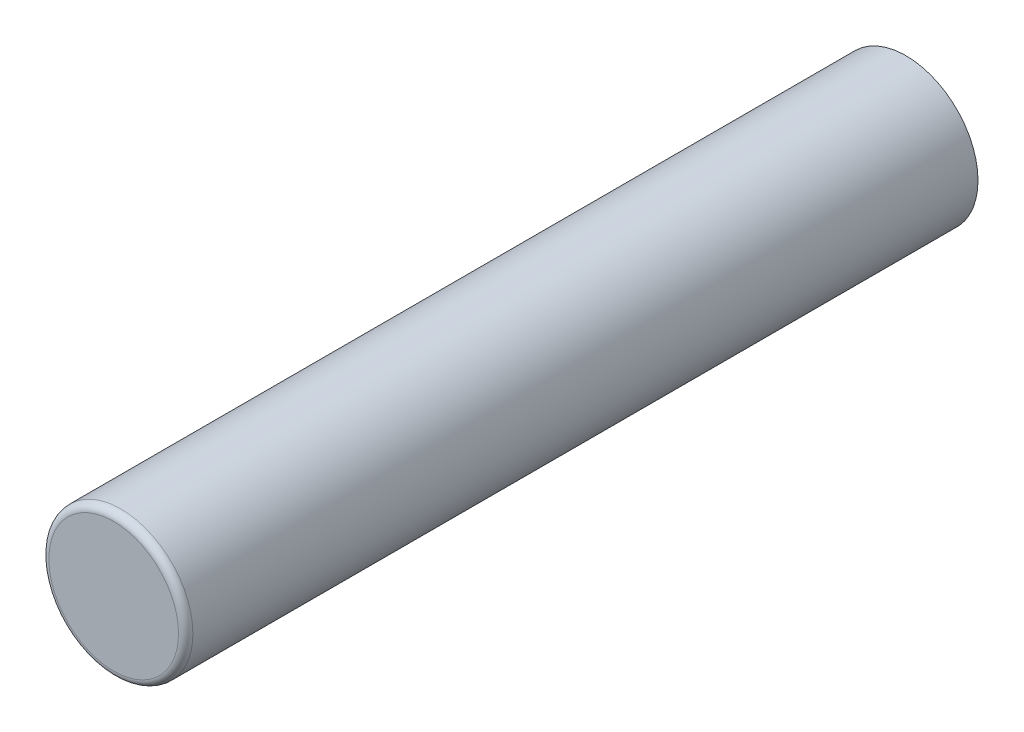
ISO-10303-21;
HEADER;
FILE_DESCRIPTION(('STEP AP214'),'2;1');
FILE_NAME('part.step','',(''),(''),'','','');
FILE_SCHEMA(('AUTOMOTIVE_DESIGN { 1 0 10303 214 1 1 1 1 }'));
ENDSEC;
DATA;
#1=APPLICATION_CONTEXT('core data for automotive mechanical design processes');
#2=APPLICATION_PROTOCOL_DEFINITION('international standard','automotive_design',2000,#1);
#3=PRODUCT_CONTEXT('',#1,'mechanical');
#4=PRODUCT('Part','Part','',(#3));
#5=PRODUCT_RELATED_PRODUCT_CATEGORY('part','',(#4));
#6=PRODUCT_DEFINITION_FORMATION('','',#4);
#7=PRODUCT_DEFINITION_CONTEXT('part definition',#1,'design');
#8=PRODUCT_DEFINITION('design','',#6,#7);
#9=PRODUCT_DEFINITION_SHAPE('','',#8);
#10=(LENGTH_UNIT() NAMED_UNIT(*) SI_UNIT(.MILLI.,.METRE.));
#11=(NAMED_UNIT(*) PLANE_ANGLE_UNIT() SI_UNIT($,.RADIAN.));
#12=(NAMED_UNIT(*) SI_UNIT($,.STERADIAN.) SOLID_ANGLE_UNIT());
#13=UNCERTAINTY_MEASURE_WITH_UNIT(LENGTH_MEASURE(1.E-05),#10,'distance_accuracy_value','');
#14=(GEOMETRIC_REPRESENTATION_CONTEXT(3) GLOBAL_UNCERTAINTY_ASSIGNED_CONTEXT((#13)) GLOBAL_UNIT_ASSIGNED_CONTEXT((#10,
#11,#12)) REPRESENTATION_CONTEXT('',''));
#15=CARTESIAN_POINT('',(0.,0.,0.));
#16=DIRECTION('',(0.,0.,1.));
#17=DIRECTION('',(1.,0.,0.));
#18=AXIS2_PLACEMENT_3D('',#15,#16,#17);
#19=CARTESIAN_POINT('',(0.,0.,5.5));
#20=DIRECTION('',(0.,0.,-1.));
#21=DIRECTION('',(-1.,0.,0.));
#22=AXIS2_PLACEMENT_3D('',#19,#20,#21);
#23=CYLINDRICAL_SURFACE('',#22,0.999999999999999);
#24=CARTESIAN_POINT('',(0.,0.,5.4));
#25=DIRECTION('',(0.,0.,1.));
#26=DIRECTION('',(1.,0.,0.));
#27=AXIS2_PLACEMENT_3D('',#24,#25,#26);
#28=CIRCLE('',#27,0.999999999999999);
#29=CARTESIAN_POINT('',(0.999999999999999,0.,5.4));
#30=VERTEX_POINT('',#29);
#31=EDGE_CURVE('E10',#30,#30,#28,.F.);
#32=ORIENTED_EDGE('',*,*,#31,.T.);
#33=EDGE_LOOP('',(#32));
#34=FACE_BOUND('',#33,.T.);
#35=CARTESIAN_POINT('',(0.,0.,-5.5));
#36=DIRECTION('',(0.,0.,1.));
#37=DIRECTION('',(1.,0.,0.));
#38=AXIS2_PLACEMENT_3D('',#35,#36,#37);
#39=CIRCLE('',#38,0.999999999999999);
#40=CARTESIAN_POINT('',(0.999999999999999,0.,-5.5));
#41=VERTEX_POINT('',#40);
#42=EDGE_CURVE('E41',#41,#41,#39,.T.);
#43=ORIENTED_EDGE('',*,*,#42,.T.);
#44=EDGE_LOOP('',(#43));
#45=FACE_BOUND('',#44,.T.);
#46=ADVANCED_FACE('F31',(#34,#45),#23,.T.);
#47=CARTESIAN_POINT('',(0.,0.,5.5));
#48=DIRECTION('',(0.,0.,1.));
#49=DIRECTION('',(1.,0.,0.));
#50=AXIS2_PLACEMENT_3D('',#47,#48,#49);
#51=PLANE('',#50);
#52=CARTESIAN_POINT('',(0.,0.,5.5));
#53=DIRECTION('',(0.,0.,1.));
#54=DIRECTION('',(1.,0.,0.));
#55=AXIS2_PLACEMENT_3D('',#52,#53,#54);
#56=CIRCLE('',#55,0.899999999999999);
#57=CARTESIAN_POINT('',(0.899999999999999,0.,5.5));
#58=VERTEX_POINT('',#57);
#59=EDGE_CURVE('E37',#58,#58,#56,.T.);
#60=ORIENTED_EDGE('',*,*,#59,.T.);
#61=EDGE_LOOP('',(#60));
#62=FACE_BOUND('',#61,.T.);
#63=ADVANCED_FACE('F52',(#62),#51,.T.);
#64=CARTESIAN_POINT('',(0.,0.,-5.5));
#65=DIRECTION('',(0.,0.,1.));
#66=DIRECTION('',(1.,0.,0.));
#67=AXIS2_PLACEMENT_3D('',#64,#65,#66);
#68=PLANE('',#67);
#69=ORIENTED_EDGE('',*,*,#42,.F.);
#70=EDGE_LOOP('',(#69));
#71=FACE_BOUND('',#70,.T.);
#72=ADVANCED_FACE('F49',(#71),#68,.F.);
#73=CARTESIAN_POINT('',(0.,0.,5.4));
#74=DIRECTION('',(0.,0.,1.));
#75=DIRECTION('',(1.,0.,0.));
#76=AXIS2_PLACEMENT_3D('',#73,#74,#75);
#77=TOROIDAL_SURFACE('',#76,0.899999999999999,0.1);
#78=ORIENTED_EDGE('',*,*,#31,.F.);
#79=EDGE_LOOP('',(#78));
#80=FACE_BOUND('',#79,.T.);
#81=ORIENTED_EDGE('',*,*,#59,.F.);
#82=EDGE_LOOP('',(#81));
#83=FACE_BOUND('',#82,.T.);
#84=ADVANCED_FACE('F51',(#80,#83),#77,.T.);
#85=CLOSED_SHELL('',(#46,#63,#72,#84));
#86=MANIFOLD_SOLID_BREP('B2',#85);
#87=ADVANCED_BREP_SHAPE_REPRESENTATION('',(#18,#86),#14);
#88=SHAPE_DEFINITION_REPRESENTATION(#9,#87);
ENDSEC;
END-ISO-10303-21;
